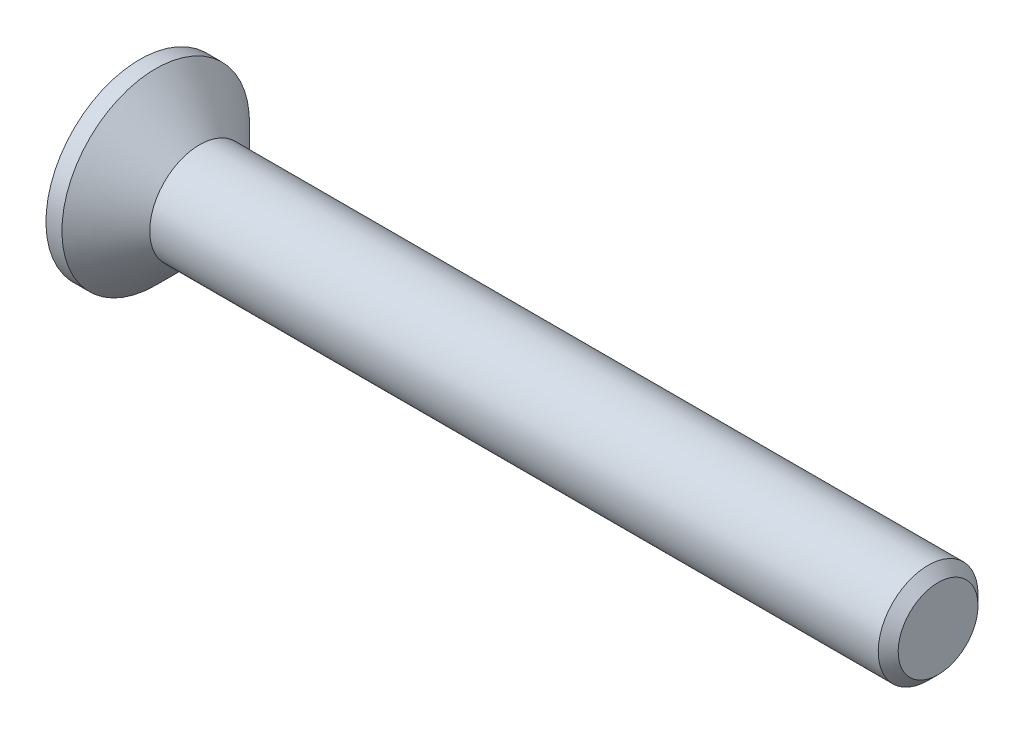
from build123d import *

# Parameters (mm, degrees)
CHAMFER1_SIZE      = 0.25
CUT_EXTRUDE1_DEPTH = 1.25


with BuildPart() as part:
    # Sketch1 → Revolve1 (revolve)
    with BuildSketch(Plane.XY, mode=Mode.PRIVATE) as revolve1_sk:
        Polygon((-1.5, 2.35), (-1.5, 0), (18.5, 0), (18.5, 1.25), (0, 1.25), (-1.1, 2.35), align=None)
    revolve(revolve1_sk.sketch.rotate(Axis((-1.5, 0, 0), (1, 0, 0)), 180), axis=Axis((-1.5, 0, 0), (1, 0, 0)))

    # Chamfer1
    chamfer1_edges = [part.edges().sort_by_distance(p)[0] for p in [
        (18.5, 1.25, 0),
    ]]
    chamfer(chamfer1_edges, length=CHAMFER1_SIZE)

    # Sketch2 → Cut-Extrude1 (cut)
    with BuildSketch(Plane.ZY.offset(1.5)):
        Polygon((-0.34, 1.35), (0.34, 1.35), (0.34, 0.34), (1.35, 0.34), (1.35, -0.34), (0.34, -0.34), (0.34, -1.35), (-0.34, -1.35), (-0.34, -0.34), (-1.35, -0.34), (-1.35, 0.34), (-0.34, 0.34), align=None)
    extrude(amount=-CUT_EXTRUDE1_DEPTH, mode=Mode.SUBTRACT)


solid = part.part
